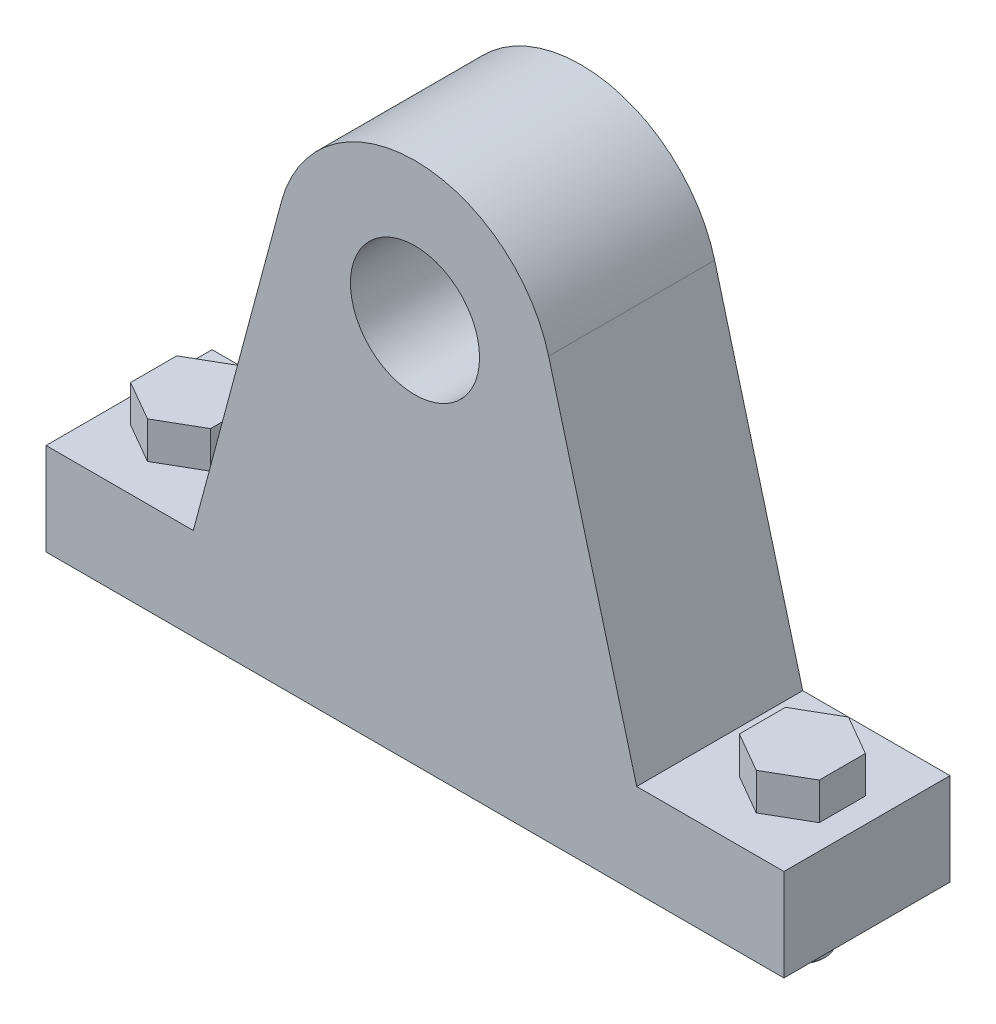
ISO-10303-21;
HEADER;
FILE_DESCRIPTION(('STEP AP214'),'2;1');
FILE_NAME('part.step','',(''),(''),'','','');
FILE_SCHEMA(('AUTOMOTIVE_DESIGN { 1 0 10303 214 1 1 1 1 }'));
ENDSEC;
DATA;
#1=APPLICATION_CONTEXT('core data for automotive mechanical design processes');
#2=APPLICATION_PROTOCOL_DEFINITION('international standard','automotive_design',2000,#1);
#3=PRODUCT_CONTEXT('',#1,'mechanical');
#4=PRODUCT('Part','Part','',(#3));
#5=PRODUCT_RELATED_PRODUCT_CATEGORY('part','',(#4));
#6=PRODUCT_DEFINITION_FORMATION('','',#4);
#7=PRODUCT_DEFINITION_CONTEXT('part definition',#1,'design');
#8=PRODUCT_DEFINITION('design','',#6,#7);
#9=PRODUCT_DEFINITION_SHAPE('','',#8);
#10=(LENGTH_UNIT() NAMED_UNIT(*) SI_UNIT(.MILLI.,.METRE.));
#11=(NAMED_UNIT(*) PLANE_ANGLE_UNIT() SI_UNIT($,.RADIAN.));
#12=(NAMED_UNIT(*) SI_UNIT($,.STERADIAN.) SOLID_ANGLE_UNIT());
#13=UNCERTAINTY_MEASURE_WITH_UNIT(LENGTH_MEASURE(1.E-05),#10,'distance_accuracy_value','');
#14=(GEOMETRIC_REPRESENTATION_CONTEXT(3) GLOBAL_UNCERTAINTY_ASSIGNED_CONTEXT((#13)) GLOBAL_UNIT_ASSIGNED_CONTEXT((#10,
#11,#12)) REPRESENTATION_CONTEXT('',''));
#15=CARTESIAN_POINT('',(0.,0.,0.));
#16=DIRECTION('',(0.,0.,1.));
#17=DIRECTION('',(1.,0.,0.));
#18=AXIS2_PLACEMENT_3D('',#15,#16,#17);
#19=CARTESIAN_POINT('',(0.,-23.3082539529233,9.));
#20=DIRECTION('',(0.,0.,1.));
#21=DIRECTION('',(1.,0.,0.));
#22=AXIS2_PLACEMENT_3D('',#19,#20,#21);
#23=PLANE('',#22);
#24=CARTESIAN_POINT('',(0.,0.,9.));
#25=DIRECTION('',(0.,0.,-1.));
#26=DIRECTION('',(-1.,0.,0.));
#27=AXIS2_PLACEMENT_3D('',#24,#25,#26);
#28=CIRCLE('',#27,7.);
#29=CARTESIAN_POINT('',(7.,0.,9.));
#30=VERTEX_POINT('',#29);
#31=EDGE_CURVE('E408',#30,#30,#28,.T.);
#32=ORIENTED_EDGE('',*,*,#31,.T.);
#33=EDGE_LOOP('',(#32));
#34=FACE_BOUND('',#33,.T.);
#35=DIRECTION('',(-1.,0.,0.));
#36=VECTOR('',#35,1.);
#37=CARTESIAN_POINT('',(40.,-41.75,9.));
#38=LINE('',#37,#36);
#39=CARTESIAN_POINT('',(40.,-41.75,9.));
#40=VERTEX_POINT('',#39);
#41=CARTESIAN_POINT('',(-40.,-41.75,9.));
#42=VERTEX_POINT('',#41);
#43=EDGE_CURVE('E394',#40,#42,#38,.T.);
#44=ORIENTED_EDGE('',*,*,#43,.F.);
#45=DIRECTION('',(0.,-1.,0.));
#46=VECTOR('',#45,1.);
#47=CARTESIAN_POINT('',(40.,-31.75,9.));
#48=LINE('',#47,#46);
#49=CARTESIAN_POINT('',(40.,-31.75,9.));
#50=VERTEX_POINT('',#49);
#51=EDGE_CURVE('E10',#50,#40,#48,.T.);
#52=ORIENTED_EDGE('',*,*,#51,.F.);
#53=DIRECTION('',(1.,0.,0.));
#54=VECTOR('',#53,1.);
#55=CARTESIAN_POINT('',(24.0365295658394,-31.75,9.));
#56=LINE('',#55,#54);
#57=CARTESIAN_POINT('',(24.0365295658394,-31.75,9.));
#58=VERTEX_POINT('',#57);
#59=EDGE_CURVE('E41',#58,#50,#56,.T.);
#60=ORIENTED_EDGE('',*,*,#59,.F.);
#61=DIRECTION('',(0.258819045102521,-0.965925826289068,0.));
#62=VECTOR('',#61,1.);
#63=CARTESIAN_POINT('',(14.488887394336,3.88228567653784,9.));
#64=LINE('',#63,#62);
#65=CARTESIAN_POINT('',(14.488887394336,3.88228567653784,9.));
#66=VERTEX_POINT('',#65);
#67=EDGE_CURVE('E465',#66,#58,#64,.T.);
#68=ORIENTED_EDGE('',*,*,#67,.F.);
#69=CARTESIAN_POINT('',(0.,0.,9.));
#70=DIRECTION('',(0.,0.,-1.));
#71=DIRECTION('',(0.965925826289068,0.258819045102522,0.));
#72=AXIS2_PLACEMENT_3D('',#69,#70,#71);
#73=CIRCLE('',#72,15.);
#74=CARTESIAN_POINT('',(-14.488887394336,3.88228567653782,9.));
#75=VERTEX_POINT('',#74);
#76=EDGE_CURVE('E275',#75,#66,#73,.T.);
#77=ORIENTED_EDGE('',*,*,#76,.F.);
#78=DIRECTION('',(0.258819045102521,0.965925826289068,0.));
#79=VECTOR('',#78,1.);
#80=CARTESIAN_POINT('',(-24.0365295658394,-31.75,9.));
#81=LINE('',#80,#79);
#82=CARTESIAN_POINT('',(-24.0365295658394,-31.75,9.));
#83=VERTEX_POINT('',#82);
#84=EDGE_CURVE('E276',#83,#75,#81,.T.);
#85=ORIENTED_EDGE('',*,*,#84,.F.);
#86=DIRECTION('',(1.,0.,0.));
#87=VECTOR('',#86,1.);
#88=CARTESIAN_POINT('',(-40.,-31.75,9.));
#89=LINE('',#88,#87);
#90=CARTESIAN_POINT('',(-40.,-31.75,9.));
#91=VERTEX_POINT('',#90);
#92=EDGE_CURVE('E358',#91,#83,#89,.T.);
#93=ORIENTED_EDGE('',*,*,#92,.F.);
#94=DIRECTION('',(0.,1.,0.));
#95=VECTOR('',#94,1.);
#96=CARTESIAN_POINT('',(-40.,-41.75,9.));
#97=LINE('',#96,#95);
#98=EDGE_CURVE('E443',#42,#91,#97,.T.);
#99=ORIENTED_EDGE('',*,*,#98,.F.);
#100=EDGE_LOOP('',(#44,#52,#60,#68,#77,#85,#93,#99));
#101=FACE_BOUND('',#100,.T.);
#102=ADVANCED_FACE('F16',(#34,#101),#23,.T.);
#103=CARTESIAN_POINT('',(40.,-31.75,0.));
#104=DIRECTION('',(1.,0.,0.));
#105=DIRECTION('',(0.,1.,0.));
#106=AXIS2_PLACEMENT_3D('',#103,#104,#105);
#107=PLANE('',#106);
#108=ORIENTED_EDGE('',*,*,#51,.T.);
#109=DIRECTION('',(0.,0.,1.));
#110=VECTOR('',#109,1.);
#111=CARTESIAN_POINT('',(40.,-41.75,-9.));
#112=LINE('',#111,#110);
#113=CARTESIAN_POINT('',(40.,-41.75,-9.));
#114=VERTEX_POINT('',#113);
#115=EDGE_CURVE('E427',#114,#40,#112,.T.);
#116=ORIENTED_EDGE('',*,*,#115,.F.);
#117=DIRECTION('',(0.,1.,0.));
#118=VECTOR('',#117,1.);
#119=CARTESIAN_POINT('',(40.,-41.75,-9.));
#120=LINE('',#119,#118);
#121=CARTESIAN_POINT('',(40.,-31.75,-9.));
#122=VERTEX_POINT('',#121);
#123=EDGE_CURVE('E411',#114,#122,#120,.T.);
#124=ORIENTED_EDGE('',*,*,#123,.T.);
#125=DIRECTION('',(0.,0.,1.));
#126=VECTOR('',#125,1.);
#127=CARTESIAN_POINT('',(40.,-31.75,-9.));
#128=LINE('',#127,#126);
#129=EDGE_CURVE('E24',#122,#50,#128,.T.);
#130=ORIENTED_EDGE('',*,*,#129,.T.);
#131=EDGE_LOOP('',(#108,#116,#124,#130));
#132=FACE_BOUND('',#131,.T.);
#133=ADVANCED_FACE('F497',(#132),#107,.T.);
#134=CARTESIAN_POINT('',(24.0365295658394,-31.75,0.));
#135=DIRECTION('',(0.,1.,0.));
#136=DIRECTION('',(1.,0.,0.));
#137=AXIS2_PLACEMENT_3D('',#134,#135,#136);
#138=PLANE('',#137);
#139=DIRECTION('',(0.866025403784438,0.,-0.5));
#140=VECTOR('',#139,1.);
#141=CARTESIAN_POINT('',(28.6698729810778,-31.75,-2.5));
#142=LINE('',#141,#140);
#143=CARTESIAN_POINT('',(28.6698729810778,-31.75,-2.5));
#144=VERTEX_POINT('',#143);
#145=CARTESIAN_POINT('',(33.,-31.75,-5.));
#146=VERTEX_POINT('',#145);
#147=EDGE_CURVE('E261',#144,#146,#142,.T.);
#148=ORIENTED_EDGE('',*,*,#147,.T.);
#149=DIRECTION('',(0.866025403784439,0.,0.5));
#150=VECTOR('',#149,1.);
#151=CARTESIAN_POINT('',(33.,-31.75,-5.));
#152=LINE('',#151,#150);
#153=CARTESIAN_POINT('',(37.3301270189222,-31.75,-2.5));
#154=VERTEX_POINT('',#153);
#155=EDGE_CURVE('E246',#146,#154,#152,.T.);
#156=ORIENTED_EDGE('',*,*,#155,.T.);
#157=DIRECTION('',(0.,0.,1.));
#158=VECTOR('',#157,1.);
#159=CARTESIAN_POINT('',(37.3301270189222,-31.75,-2.5));
#160=LINE('',#159,#158);
#161=CARTESIAN_POINT('',(37.3301270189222,-31.75,2.5));
#162=VERTEX_POINT('',#161);
#163=EDGE_CURVE('E299',#154,#162,#160,.T.);
#164=ORIENTED_EDGE('',*,*,#163,.T.);
#165=DIRECTION('',(-0.866025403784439,0.,0.5));
#166=VECTOR('',#165,1.);
#167=CARTESIAN_POINT('',(37.3301270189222,-31.75,2.5));
#168=LINE('',#167,#166);
#169=CARTESIAN_POINT('',(33.,-31.75,5.));
#170=VERTEX_POINT('',#169);
#171=EDGE_CURVE('E311',#162,#170,#168,.T.);
#172=ORIENTED_EDGE('',*,*,#171,.T.);
#173=DIRECTION('',(-0.866025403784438,0.,-0.5));
#174=VECTOR('',#173,1.);
#175=CARTESIAN_POINT('',(33.,-31.75,5.));
#176=LINE('',#175,#174);
#177=CARTESIAN_POINT('',(28.6698729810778,-31.75,2.5));
#178=VERTEX_POINT('',#177);
#179=EDGE_CURVE('E323',#170,#178,#176,.T.);
#180=ORIENTED_EDGE('',*,*,#179,.T.);
#181=DIRECTION('',(0.,0.,-1.));
#182=VECTOR('',#181,1.);
#183=CARTESIAN_POINT('',(28.6698729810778,-31.75,2.5));
#184=LINE('',#183,#182);
#185=EDGE_CURVE('E330',#178,#144,#184,.T.);
#186=ORIENTED_EDGE('',*,*,#185,.T.);
#187=EDGE_LOOP('',(#148,#156,#164,#172,#180,#186));
#188=FACE_BOUND('',#187,.T.);
#189=ORIENTED_EDGE('',*,*,#59,.T.);
#190=ORIENTED_EDGE('',*,*,#129,.F.);
#191=DIRECTION('',(-1.,0.,0.));
#192=VECTOR('',#191,1.);
#193=CARTESIAN_POINT('',(40.,-31.75,-9.));
#194=LINE('',#193,#192);
#195=CARTESIAN_POINT('',(24.0365295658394,-31.75,-9.));
#196=VERTEX_POINT('',#195);
#197=EDGE_CURVE('E390',#122,#196,#194,.T.);
#198=ORIENTED_EDGE('',*,*,#197,.T.);
#199=DIRECTION('',(0.,0.,1.));
#200=VECTOR('',#199,1.);
#201=CARTESIAN_POINT('',(24.0365295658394,-31.75,-9.));
#202=LINE('',#201,#200);
#203=EDGE_CURVE('E469',#196,#58,#202,.T.);
#204=ORIENTED_EDGE('',*,*,#203,.T.);
#205=EDGE_LOOP('',(#189,#190,#198,#204));
#206=FACE_BOUND('',#205,.T.);
#207=ADVANCED_FACE('F475',(#188,#206),#138,.T.);
#208=CARTESIAN_POINT('',(14.488887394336,3.88228567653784,0.));
#209=DIRECTION('',(0.965925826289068,0.258819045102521,0.));
#210=DIRECTION('',(0.,0.,-1.));
#211=AXIS2_PLACEMENT_3D('',#208,#209,#210);
#212=PLANE('',#211);
#213=ORIENTED_EDGE('',*,*,#67,.T.);
#214=ORIENTED_EDGE('',*,*,#203,.F.);
#215=DIRECTION('',(-0.258819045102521,0.965925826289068,0.));
#216=VECTOR('',#215,1.);
#217=CARTESIAN_POINT('',(24.0365295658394,-31.75,-9.));
#218=LINE('',#217,#216);
#219=CARTESIAN_POINT('',(14.488887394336,3.88228567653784,-9.));
#220=VERTEX_POINT('',#219);
#221=EDGE_CURVE('E395',#196,#220,#218,.T.);
#222=ORIENTED_EDGE('',*,*,#221,.T.);
#223=DIRECTION('',(0.,0.,1.));
#224=VECTOR('',#223,1.);
#225=CARTESIAN_POINT('',(14.488887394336,3.88228567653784,-9.));
#226=LINE('',#225,#224);
#227=EDGE_CURVE('E461',#220,#66,#226,.T.);
#228=ORIENTED_EDGE('',*,*,#227,.T.);
#229=EDGE_LOOP('',(#213,#214,#222,#228));
#230=FACE_BOUND('',#229,.T.);
#231=ADVANCED_FACE('F479',(#230),#212,.T.);
#232=CARTESIAN_POINT('',(0.,0.,0.));
#233=DIRECTION('',(0.,0.,1.));
#234=DIRECTION('',(0.965925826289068,0.258819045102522,0.));
#235=AXIS2_PLACEMENT_3D('',#232,#233,#234);
#236=CYLINDRICAL_SURFACE('',#235,15.);
#237=ORIENTED_EDGE('',*,*,#76,.T.);
#238=ORIENTED_EDGE('',*,*,#227,.F.);
#239=CARTESIAN_POINT('',(0.,0.,-9.));
#240=DIRECTION('',(0.,0.,1.));
#241=DIRECTION('',(0.965925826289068,0.258819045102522,0.));
#242=AXIS2_PLACEMENT_3D('',#239,#240,#241);
#243=CIRCLE('',#242,15.);
#244=CARTESIAN_POINT('',(-14.488887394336,3.88228567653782,-9.));
#245=VERTEX_POINT('',#244);
#246=EDGE_CURVE('E384',#220,#245,#243,.T.);
#247=ORIENTED_EDGE('',*,*,#246,.T.);
#248=DIRECTION('',(0.,0.,1.));
#249=VECTOR('',#248,1.);
#250=CARTESIAN_POINT('',(-14.488887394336,3.88228567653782,-9.));
#251=LINE('',#250,#249);
#252=EDGE_CURVE('E271',#245,#75,#251,.T.);
#253=ORIENTED_EDGE('',*,*,#252,.T.);
#254=EDGE_LOOP('',(#237,#238,#247,#253));
#255=FACE_BOUND('',#254,.T.);
#256=ADVANCED_FACE('F481',(#255),#236,.T.);
#257=CARTESIAN_POINT('',(-24.0365295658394,-31.75,0.));
#258=DIRECTION('',(-0.965925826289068,0.258819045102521,0.));
#259=DIRECTION('',(0.,0.,1.));
#260=AXIS2_PLACEMENT_3D('',#257,#258,#259);
#261=PLANE('',#260);
#262=ORIENTED_EDGE('',*,*,#84,.T.);
#263=ORIENTED_EDGE('',*,*,#252,.F.);
#264=DIRECTION('',(-0.258819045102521,-0.965925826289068,0.));
#265=VECTOR('',#264,1.);
#266=CARTESIAN_POINT('',(-14.488887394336,3.88228567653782,-9.));
#267=LINE('',#266,#265);
#268=CARTESIAN_POINT('',(-24.0365295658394,-31.75,-9.));
#269=VERTEX_POINT('',#268);
#270=EDGE_CURVE('E380',#245,#269,#267,.T.);
#271=ORIENTED_EDGE('',*,*,#270,.T.);
#272=DIRECTION('',(0.,0.,1.));
#273=VECTOR('',#272,1.);
#274=CARTESIAN_POINT('',(-24.0365295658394,-31.75,-9.));
#275=LINE('',#274,#273);
#276=EDGE_CURVE('E362',#269,#83,#275,.T.);
#277=ORIENTED_EDGE('',*,*,#276,.T.);
#278=EDGE_LOOP('',(#262,#263,#271,#277));
#279=FACE_BOUND('',#278,.T.);
#280=ADVANCED_FACE('F485',(#279),#261,.T.);
#281=CARTESIAN_POINT('',(-40.,-31.75,0.));
#282=DIRECTION('',(0.,1.,0.));
#283=DIRECTION('',(1.,0.,0.));
#284=AXIS2_PLACEMENT_3D('',#281,#282,#283);
#285=PLANE('',#284);
#286=DIRECTION('',(0.866025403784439,0.,0.5));
#287=VECTOR('',#286,1.);
#288=CARTESIAN_POINT('',(-33.,-31.75,-5.));
#289=LINE('',#288,#287);
#290=CARTESIAN_POINT('',(-33.,-31.75,-5.));
#291=VERTEX_POINT('',#290);
#292=CARTESIAN_POINT('',(-28.6698729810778,-31.75,-2.5));
#293=VERTEX_POINT('',#292);
#294=EDGE_CURVE('E337',#291,#293,#289,.T.);
#295=ORIENTED_EDGE('',*,*,#294,.T.);
#296=DIRECTION('',(0.,0.,1.));
#297=VECTOR('',#296,1.);
#298=CARTESIAN_POINT('',(-28.6698729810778,-31.75,-2.5));
#299=LINE('',#298,#297);
#300=CARTESIAN_POINT('',(-28.6698729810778,-31.75,2.5));
#301=VERTEX_POINT('',#300);
#302=EDGE_CURVE('E294',#293,#301,#299,.T.);
#303=ORIENTED_EDGE('',*,*,#302,.T.);
#304=DIRECTION('',(-0.866025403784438,0.,0.5));
#305=VECTOR('',#304,1.);
#306=CARTESIAN_POINT('',(-28.6698729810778,-31.75,2.5));
#307=LINE('',#306,#305);
#308=CARTESIAN_POINT('',(-33.,-31.75,5.));
#309=VERTEX_POINT('',#308);
#310=EDGE_CURVE('E353',#301,#309,#307,.T.);
#311=ORIENTED_EDGE('',*,*,#310,.T.);
#312=DIRECTION('',(-0.866025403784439,0.,-0.5));
#313=VECTOR('',#312,1.);
#314=CARTESIAN_POINT('',(-33.,-31.75,5.));
#315=LINE('',#314,#313);
#316=CARTESIAN_POINT('',(-37.3301270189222,-31.75,2.5));
#317=VERTEX_POINT('',#316);
#318=EDGE_CURVE('E371',#309,#317,#315,.T.);
#319=ORIENTED_EDGE('',*,*,#318,.T.);
#320=DIRECTION('',(0.,0.,-1.));
#321=VECTOR('',#320,1.);
#322=CARTESIAN_POINT('',(-37.3301270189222,-31.75,2.5));
#323=LINE('',#322,#321);
#324=CARTESIAN_POINT('',(-37.3301270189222,-31.75,-2.5));
#325=VERTEX_POINT('',#324);
#326=EDGE_CURVE('E389',#317,#325,#323,.T.);
#327=ORIENTED_EDGE('',*,*,#326,.T.);
#328=DIRECTION('',(0.866025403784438,0.,-0.5));
#329=VECTOR('',#328,1.);
#330=CARTESIAN_POINT('',(-37.3301270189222,-31.75,-2.5));
#331=LINE('',#330,#329);
#332=EDGE_CURVE('E402',#325,#291,#331,.T.);
#333=ORIENTED_EDGE('',*,*,#332,.T.);
#334=EDGE_LOOP('',(#295,#303,#311,#319,#327,#333));
#335=FACE_BOUND('',#334,.T.);
#336=ORIENTED_EDGE('',*,*,#92,.T.);
#337=ORIENTED_EDGE('',*,*,#276,.F.);
#338=DIRECTION('',(-1.,0.,0.));
#339=VECTOR('',#338,1.);
#340=CARTESIAN_POINT('',(-24.0365295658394,-31.75,-9.));
#341=LINE('',#340,#339);
#342=CARTESIAN_POINT('',(-40.,-31.75,-9.));
#343=VERTEX_POINT('',#342);
#344=EDGE_CURVE('E385',#269,#343,#341,.T.);
#345=ORIENTED_EDGE('',*,*,#344,.T.);
#346=DIRECTION('',(0.,0.,1.));
#347=VECTOR('',#346,1.);
#348=CARTESIAN_POINT('',(-40.,-31.75,-9.));
#349=LINE('',#348,#347);
#350=EDGE_CURVE('E363',#343,#91,#349,.T.);
#351=ORIENTED_EDGE('',*,*,#350,.T.);
#352=EDGE_LOOP('',(#336,#337,#345,#351));
#353=FACE_BOUND('',#352,.T.);
#354=ADVANCED_FACE('F488',(#335,#353),#285,.T.);
#355=CARTESIAN_POINT('',(-40.,-41.75,0.));
#356=DIRECTION('',(-1.,0.,0.));
#357=DIRECTION('',(0.,0.,1.));
#358=AXIS2_PLACEMENT_3D('',#355,#356,#357);
#359=PLANE('',#358);
#360=ORIENTED_EDGE('',*,*,#98,.T.);
#361=ORIENTED_EDGE('',*,*,#350,.F.);
#362=DIRECTION('',(0.,-1.,0.));
#363=VECTOR('',#362,1.);
#364=CARTESIAN_POINT('',(-40.,-31.75,-9.));
#365=LINE('',#364,#363);
#366=CARTESIAN_POINT('',(-40.,-41.75,-9.));
#367=VERTEX_POINT('',#366);
#368=EDGE_CURVE('E419',#343,#367,#365,.T.);
#369=ORIENTED_EDGE('',*,*,#368,.T.);
#370=DIRECTION('',(0.,0.,1.));
#371=VECTOR('',#370,1.);
#372=CARTESIAN_POINT('',(-40.,-41.75,-9.));
#373=LINE('',#372,#371);
#374=EDGE_CURVE('E423',#367,#42,#373,.T.);
#375=ORIENTED_EDGE('',*,*,#374,.T.);
#376=EDGE_LOOP('',(#360,#361,#369,#375));
#377=FACE_BOUND('',#376,.T.);
#378=ADVANCED_FACE('F490',(#377),#359,.T.);
#379=CARTESIAN_POINT('',(0.,-41.75,0.));
#380=DIRECTION('',(0.,-1.,0.));
#381=DIRECTION('',(0.,0.,-1.));
#382=AXIS2_PLACEMENT_3D('',#379,#380,#381);
#383=PLANE('',#382);
#384=CARTESIAN_POINT('',(-33.,-41.75,0.));
#385=DIRECTION('',(0.,1.,0.));
#386=DIRECTION('',(-1.,0.,0.));
#387=AXIS2_PLACEMENT_3D('',#384,#385,#386);
#388=CIRCLE('',#387,2.5);
#389=CARTESIAN_POINT('',(-30.5,-41.75,0.));
#390=VERTEX_POINT('',#389);
#391=EDGE_CURVE('E257',#390,#390,#388,.T.);
#392=ORIENTED_EDGE('',*,*,#391,.T.);
#393=EDGE_LOOP('',(#392));
#394=FACE_BOUND('',#393,.T.);
#395=CARTESIAN_POINT('',(33.,-41.75,0.));
#396=DIRECTION('',(0.,1.,0.));
#397=DIRECTION('',(-1.,0.,0.));
#398=AXIS2_PLACEMENT_3D('',#395,#396,#397);
#399=CIRCLE('',#398,2.5);
#400=CARTESIAN_POINT('',(35.5,-41.75,0.));
#401=VERTEX_POINT('',#400);
#402=EDGE_CURVE('E237',#401,#401,#399,.T.);
#403=ORIENTED_EDGE('',*,*,#402,.T.);
#404=EDGE_LOOP('',(#403));
#405=FACE_BOUND('',#404,.T.);
#406=ORIENTED_EDGE('',*,*,#43,.T.);
#407=ORIENTED_EDGE('',*,*,#374,.F.);
#408=DIRECTION('',(1.,0.,0.));
#409=VECTOR('',#408,1.);
#410=CARTESIAN_POINT('',(-40.,-41.75,-9.));
#411=LINE('',#410,#409);
#412=EDGE_CURVE('E415',#367,#114,#411,.T.);
#413=ORIENTED_EDGE('',*,*,#412,.T.);
#414=ORIENTED_EDGE('',*,*,#115,.T.);
#415=EDGE_LOOP('',(#406,#407,#413,#414));
#416=FACE_BOUND('',#415,.T.);
#417=ADVANCED_FACE('F494',(#394,#405,#416),#383,.T.);
#418=CARTESIAN_POINT('',(0.,-23.3082539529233,-9.));
#419=DIRECTION('',(0.,0.,1.));
#420=DIRECTION('',(1.,0.,0.));
#421=AXIS2_PLACEMENT_3D('',#418,#419,#420);
#422=PLANE('',#421);
#423=CARTESIAN_POINT('',(0.,0.,-9.));
#424=DIRECTION('',(0.,0.,1.));
#425=DIRECTION('',(-1.,0.,0.));
#426=AXIS2_PLACEMENT_3D('',#423,#424,#425);
#427=CIRCLE('',#426,7.);
#428=CARTESIAN_POINT('',(7.,0.,-9.));
#429=VERTEX_POINT('',#428);
#430=EDGE_CURVE('E405',#429,#429,#427,.T.);
#431=ORIENTED_EDGE('',*,*,#430,.T.);
#432=EDGE_LOOP('',(#431));
#433=FACE_BOUND('',#432,.T.);
#434=ORIENTED_EDGE('',*,*,#123,.F.);
#435=ORIENTED_EDGE('',*,*,#412,.F.);
#436=ORIENTED_EDGE('',*,*,#368,.F.);
#437=ORIENTED_EDGE('',*,*,#344,.F.);
#438=ORIENTED_EDGE('',*,*,#270,.F.);
#439=ORIENTED_EDGE('',*,*,#246,.F.);
#440=ORIENTED_EDGE('',*,*,#221,.F.);
#441=ORIENTED_EDGE('',*,*,#197,.F.);
#442=EDGE_LOOP('',(#434,#435,#436,#437,#438,#439,#440,#441));
#443=FACE_BOUND('',#442,.T.);
#444=ADVANCED_FACE('F499',(#433,#443),#422,.F.);
#445=CARTESIAN_POINT('',(0.,0.,0.));
#446=DIRECTION('',(0.,0.,1.));
#447=DIRECTION('',(-1.,0.,0.));
#448=AXIS2_PLACEMENT_3D('',#445,#446,#447);
#449=CYLINDRICAL_SURFACE('',#448,7.);
#450=ORIENTED_EDGE('',*,*,#31,.F.);
#451=EDGE_LOOP('',(#450));
#452=FACE_BOUND('',#451,.T.);
#453=ORIENTED_EDGE('',*,*,#430,.F.);
#454=EDGE_LOOP('',(#453));
#455=FACE_BOUND('',#454,.T.);
#456=ADVANCED_FACE('F501',(#452,#455),#449,.F.);
#457=CARTESIAN_POINT('',(-33.,-27.75,0.));
#458=DIRECTION('',(0.,1.,0.));
#459=DIRECTION('',(1.,0.,0.));
#460=AXIS2_PLACEMENT_3D('',#457,#458,#459);
#461=PLANE('',#460);
#462=DIRECTION('',(0.866025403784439,0.,0.5));
#463=VECTOR('',#462,1.);
#464=CARTESIAN_POINT('',(-33.,-27.75,-5.));
#465=LINE('',#464,#463);
#466=CARTESIAN_POINT('',(-33.,-27.75,-5.));
#467=VERTEX_POINT('',#466);
#468=CARTESIAN_POINT('',(-28.6698729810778,-27.75,-2.5));
#469=VERTEX_POINT('',#468);
#470=EDGE_CURVE('E240',#467,#469,#465,.T.);
#471=ORIENTED_EDGE('',*,*,#470,.F.);
#472=DIRECTION('',(0.866025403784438,0.,-0.5));
#473=VECTOR('',#472,1.);
#474=CARTESIAN_POINT('',(-37.3301270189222,-27.75,-2.5));
#475=LINE('',#474,#473);
#476=CARTESIAN_POINT('',(-37.3301270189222,-27.75,-2.5));
#477=VERTEX_POINT('',#476);
#478=EDGE_CURVE('E399',#477,#467,#475,.T.);
#479=ORIENTED_EDGE('',*,*,#478,.F.);
#480=DIRECTION('',(0.,0.,-1.));
#481=VECTOR('',#480,1.);
#482=CARTESIAN_POINT('',(-37.3301270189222,-27.75,2.5));
#483=LINE('',#482,#481);
#484=CARTESIAN_POINT('',(-37.3301270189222,-27.75,2.5));
#485=VERTEX_POINT('',#484);
#486=EDGE_CURVE('E375',#485,#477,#483,.T.);
#487=ORIENTED_EDGE('',*,*,#486,.F.);
#488=DIRECTION('',(-0.866025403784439,0.,-0.5));
#489=VECTOR('',#488,1.);
#490=CARTESIAN_POINT('',(-33.,-27.75,5.));
#491=LINE('',#490,#489);
#492=CARTESIAN_POINT('',(-33.,-27.75,5.));
#493=VERTEX_POINT('',#492);
#494=EDGE_CURVE('E357',#493,#485,#491,.T.);
#495=ORIENTED_EDGE('',*,*,#494,.F.);
#496=DIRECTION('',(-0.866025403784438,0.,0.5));
#497=VECTOR('',#496,1.);
#498=CARTESIAN_POINT('',(-28.6698729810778,-27.75,2.5));
#499=LINE('',#498,#497);
#500=CARTESIAN_POINT('',(-28.6698729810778,-27.75,2.5));
#501=VERTEX_POINT('',#500);
#502=EDGE_CURVE('E345',#501,#493,#499,.T.);
#503=ORIENTED_EDGE('',*,*,#502,.F.);
#504=DIRECTION('',(0.,0.,1.));
#505=VECTOR('',#504,1.);
#506=CARTESIAN_POINT('',(-28.6698729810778,-27.75,-2.5));
#507=LINE('',#506,#505);
#508=EDGE_CURVE('E295',#469,#501,#507,.T.);
#509=ORIENTED_EDGE('',*,*,#508,.F.);
#510=EDGE_LOOP('',(#471,#479,#487,#495,#503,#509));
#511=FACE_BOUND('',#510,.T.);
#512=ADVANCED_FACE('F509',(#511),#461,.T.);
#513=CARTESIAN_POINT('',(-37.3301270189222,-31.75,-2.5));
#514=DIRECTION('',(-0.5,0.,-0.866025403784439));
#515=DIRECTION('',(-0.866025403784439,0.,0.5));
#516=AXIS2_PLACEMENT_3D('',#513,#514,#515);
#517=PLANE('',#516);
#518=ORIENTED_EDGE('',*,*,#478,.T.);
#519=DIRECTION('',(0.,1.,0.));
#520=VECTOR('',#519,1.);
#521=CARTESIAN_POINT('',(-33.,-31.75,-5.));
#522=LINE('',#521,#520);
#523=EDGE_CURVE('E338',#291,#467,#522,.T.);
#524=ORIENTED_EDGE('',*,*,#523,.F.);
#525=ORIENTED_EDGE('',*,*,#332,.F.);
#526=DIRECTION('',(0.,1.,0.));
#527=VECTOR('',#526,1.);
#528=CARTESIAN_POINT('',(-37.3301270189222,-31.75,-2.5));
#529=LINE('',#528,#527);
#530=EDGE_CURVE('E379',#325,#477,#529,.T.);
#531=ORIENTED_EDGE('',*,*,#530,.T.);
#532=EDGE_LOOP('',(#518,#524,#525,#531));
#533=FACE_BOUND('',#532,.T.);
#534=ADVANCED_FACE('F575',(#533),#517,.T.);
#535=CARTESIAN_POINT('',(-37.3301270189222,-31.75,2.5));
#536=DIRECTION('',(-1.,0.,0.));
#537=DIRECTION('',(0.,0.,1.));
#538=AXIS2_PLACEMENT_3D('',#535,#536,#537);
#539=PLANE('',#538);
#540=ORIENTED_EDGE('',*,*,#486,.T.);
#541=ORIENTED_EDGE('',*,*,#530,.F.);
#542=ORIENTED_EDGE('',*,*,#326,.F.);
#543=DIRECTION('',(0.,1.,0.));
#544=VECTOR('',#543,1.);
#545=CARTESIAN_POINT('',(-37.3301270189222,-31.75,2.5));
#546=LINE('',#545,#544);
#547=EDGE_CURVE('E367',#317,#485,#546,.T.);
#548=ORIENTED_EDGE('',*,*,#547,.T.);
#549=EDGE_LOOP('',(#540,#541,#542,#548));
#550=FACE_BOUND('',#549,.T.);
#551=ADVANCED_FACE('F586',(#550),#539,.T.);
#552=CARTESIAN_POINT('',(-33.,-31.75,5.));
#553=DIRECTION('',(-0.5,0.,0.866025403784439));
#554=DIRECTION('',(0.,1.,0.));
#555=AXIS2_PLACEMENT_3D('',#552,#553,#554);
#556=PLANE('',#555);
#557=ORIENTED_EDGE('',*,*,#494,.T.);
#558=ORIENTED_EDGE('',*,*,#547,.F.);
#559=ORIENTED_EDGE('',*,*,#318,.F.);
#560=DIRECTION('',(0.,1.,0.));
#561=VECTOR('',#560,1.);
#562=CARTESIAN_POINT('',(-33.,-31.75,5.));
#563=LINE('',#562,#561);
#564=EDGE_CURVE('E349',#309,#493,#563,.T.);
#565=ORIENTED_EDGE('',*,*,#564,.T.);
#566=EDGE_LOOP('',(#557,#558,#559,#565));
#567=FACE_BOUND('',#566,.T.);
#568=ADVANCED_FACE('F597',(#567),#556,.T.);
#569=CARTESIAN_POINT('',(-28.6698729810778,-31.75,2.5));
#570=DIRECTION('',(0.5,0.,0.866025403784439));
#571=DIRECTION('',(0.,-1.,0.));
#572=AXIS2_PLACEMENT_3D('',#569,#570,#571);
#573=PLANE('',#572);
#574=ORIENTED_EDGE('',*,*,#502,.T.);
#575=ORIENTED_EDGE('',*,*,#564,.F.);
#576=ORIENTED_EDGE('',*,*,#310,.F.);
#577=DIRECTION('',(0.,1.,0.));
#578=VECTOR('',#577,1.);
#579=CARTESIAN_POINT('',(-28.6698729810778,-31.75,2.5));
#580=LINE('',#579,#578);
#581=EDGE_CURVE('E290',#301,#501,#580,.T.);
#582=ORIENTED_EDGE('',*,*,#581,.T.);
#583=EDGE_LOOP('',(#574,#575,#576,#582));
#584=FACE_BOUND('',#583,.T.);
#585=ADVANCED_FACE('F608',(#584),#573,.T.);
#586=CARTESIAN_POINT('',(-28.6698729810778,-31.75,-2.5));
#587=DIRECTION('',(1.,0.,0.));
#588=DIRECTION('',(0.,1.,0.));
#589=AXIS2_PLACEMENT_3D('',#586,#587,#588);
#590=PLANE('',#589);
#591=ORIENTED_EDGE('',*,*,#508,.T.);
#592=ORIENTED_EDGE('',*,*,#581,.F.);
#593=ORIENTED_EDGE('',*,*,#302,.F.);
#594=DIRECTION('',(0.,1.,0.));
#595=VECTOR('',#594,1.);
#596=CARTESIAN_POINT('',(-28.6698729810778,-31.75,-2.5));
#597=LINE('',#596,#595);
#598=EDGE_CURVE('E333',#293,#469,#597,.T.);
#599=ORIENTED_EDGE('',*,*,#598,.T.);
#600=EDGE_LOOP('',(#591,#592,#593,#599));
#601=FACE_BOUND('',#600,.T.);
#602=ADVANCED_FACE('F620',(#601),#590,.T.);
#603=CARTESIAN_POINT('',(-33.,-31.75,-5.));
#604=DIRECTION('',(0.5,0.,-0.866025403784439));
#605=DIRECTION('',(0.,-1.,0.));
#606=AXIS2_PLACEMENT_3D('',#603,#604,#605);
#607=PLANE('',#606);
#608=ORIENTED_EDGE('',*,*,#470,.T.);
#609=ORIENTED_EDGE('',*,*,#598,.F.);
#610=ORIENTED_EDGE('',*,*,#294,.F.);
#611=ORIENTED_EDGE('',*,*,#523,.T.);
#612=EDGE_LOOP('',(#608,#609,#610,#611));
#613=FACE_BOUND('',#612,.T.);
#614=ADVANCED_FACE('F632',(#613),#607,.T.);
#615=CARTESIAN_POINT('',(33.,-27.75,0.));
#616=DIRECTION('',(0.,1.,0.));
#617=DIRECTION('',(1.,0.,0.));
#618=AXIS2_PLACEMENT_3D('',#615,#616,#617);
#619=PLANE('',#618);
#620=DIRECTION('',(0.866025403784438,0.,-0.5));
#621=VECTOR('',#620,1.);
#622=CARTESIAN_POINT('',(28.6698729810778,-27.75,-2.5));
#623=LINE('',#622,#621);
#624=CARTESIAN_POINT('',(28.6698729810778,-27.75,-2.5));
#625=VERTEX_POINT('',#624);
#626=CARTESIAN_POINT('',(33.,-27.75,-5.));
#627=VERTEX_POINT('',#626);
#628=EDGE_CURVE('E260',#625,#627,#623,.T.);
#629=ORIENTED_EDGE('',*,*,#628,.F.);
#630=DIRECTION('',(0.,0.,-1.));
#631=VECTOR('',#630,1.);
#632=CARTESIAN_POINT('',(28.6698729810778,-27.75,2.5));
#633=LINE('',#632,#631);
#634=CARTESIAN_POINT('',(28.6698729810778,-27.75,2.5));
#635=VERTEX_POINT('',#634);
#636=EDGE_CURVE('E327',#635,#625,#633,.T.);
#637=ORIENTED_EDGE('',*,*,#636,.F.);
#638=DIRECTION('',(-0.866025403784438,0.,-0.5));
#639=VECTOR('',#638,1.);
#640=CARTESIAN_POINT('',(33.,-27.75,5.));
#641=LINE('',#640,#639);
#642=CARTESIAN_POINT('',(33.,-27.75,5.));
#643=VERTEX_POINT('',#642);
#644=EDGE_CURVE('E315',#643,#635,#641,.T.);
#645=ORIENTED_EDGE('',*,*,#644,.F.);
#646=DIRECTION('',(-0.866025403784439,0.,0.5));
#647=VECTOR('',#646,1.);
#648=CARTESIAN_POINT('',(37.3301270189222,-27.75,2.5));
#649=LINE('',#648,#647);
#650=CARTESIAN_POINT('',(37.3301270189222,-27.75,2.5));
#651=VERTEX_POINT('',#650);
#652=EDGE_CURVE('E303',#651,#643,#649,.T.);
#653=ORIENTED_EDGE('',*,*,#652,.F.);
#654=DIRECTION('',(0.,0.,1.));
#655=VECTOR('',#654,1.);
#656=CARTESIAN_POINT('',(37.3301270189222,-27.75,-2.5));
#657=LINE('',#656,#655);
#658=CARTESIAN_POINT('',(37.3301270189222,-27.75,-2.5));
#659=VERTEX_POINT('',#658);
#660=EDGE_CURVE('E250',#659,#651,#657,.T.);
#661=ORIENTED_EDGE('',*,*,#660,.F.);
#662=DIRECTION('',(0.866025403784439,0.,0.5));
#663=VECTOR('',#662,1.);
#664=CARTESIAN_POINT('',(33.,-27.75,-5.));
#665=LINE('',#664,#663);
#666=EDGE_CURVE('E270',#627,#659,#665,.T.);
#667=ORIENTED_EDGE('',*,*,#666,.F.);
#668=EDGE_LOOP('',(#629,#637,#645,#653,#661,#667));
#669=FACE_BOUND('',#668,.T.);
#670=ADVANCED_FACE('F644',(#669),#619,.T.);
#671=CARTESIAN_POINT('',(28.6698729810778,-31.75,2.5));
#672=DIRECTION('',(-1.,0.,0.));
#673=DIRECTION('',(0.,0.,1.));
#674=AXIS2_PLACEMENT_3D('',#671,#672,#673);
#675=PLANE('',#674);
#676=ORIENTED_EDGE('',*,*,#636,.T.);
#677=DIRECTION('',(0.,1.,0.));
#678=VECTOR('',#677,1.);
#679=CARTESIAN_POINT('',(28.6698729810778,-31.75,-2.5));
#680=LINE('',#679,#678);
#681=EDGE_CURVE('E265',#144,#625,#680,.T.);
#682=ORIENTED_EDGE('',*,*,#681,.F.);
#683=ORIENTED_EDGE('',*,*,#185,.F.);
#684=DIRECTION('',(0.,1.,0.));
#685=VECTOR('',#684,1.);
#686=CARTESIAN_POINT('',(28.6698729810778,-31.75,2.5));
#687=LINE('',#686,#685);
#688=EDGE_CURVE('E319',#178,#635,#687,.T.);
#689=ORIENTED_EDGE('',*,*,#688,.T.);
#690=EDGE_LOOP('',(#676,#682,#683,#689));
#691=FACE_BOUND('',#690,.T.);
#692=ADVANCED_FACE('F656',(#691),#675,.T.);
#693=CARTESIAN_POINT('',(33.,-31.75,5.));
#694=DIRECTION('',(-0.5,0.,0.866025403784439));
#695=DIRECTION('',(0.,1.,0.));
#696=AXIS2_PLACEMENT_3D('',#693,#694,#695);
#697=PLANE('',#696);
#698=ORIENTED_EDGE('',*,*,#644,.T.);
#699=ORIENTED_EDGE('',*,*,#688,.F.);
#700=ORIENTED_EDGE('',*,*,#179,.F.);
#701=DIRECTION('',(0.,1.,0.));
#702=VECTOR('',#701,1.);
#703=CARTESIAN_POINT('',(33.,-31.75,5.));
#704=LINE('',#703,#702);
#705=EDGE_CURVE('E307',#170,#643,#704,.T.);
#706=ORIENTED_EDGE('',*,*,#705,.T.);
#707=EDGE_LOOP('',(#698,#699,#700,#706));
#708=FACE_BOUND('',#707,.T.);
#709=ADVANCED_FACE('F667',(#708),#697,.T.);
#710=CARTESIAN_POINT('',(37.3301270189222,-31.75,2.5));
#711=DIRECTION('',(0.5,0.,0.866025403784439));
#712=DIRECTION('',(0.,-1.,0.));
#713=AXIS2_PLACEMENT_3D('',#710,#711,#712);
#714=PLANE('',#713);
#715=ORIENTED_EDGE('',*,*,#652,.T.);
#716=ORIENTED_EDGE('',*,*,#705,.F.);
#717=ORIENTED_EDGE('',*,*,#171,.F.);
#718=DIRECTION('',(0.,1.,0.));
#719=VECTOR('',#718,1.);
#720=CARTESIAN_POINT('',(37.3301270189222,-31.75,2.5));
#721=LINE('',#720,#719);
#722=EDGE_CURVE('E283',#162,#651,#721,.T.);
#723=ORIENTED_EDGE('',*,*,#722,.T.);
#724=EDGE_LOOP('',(#715,#716,#717,#723));
#725=FACE_BOUND('',#724,.T.);
#726=ADVANCED_FACE('F679',(#725),#714,.T.);
#727=CARTESIAN_POINT('',(37.3301270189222,-31.75,-2.5));
#728=DIRECTION('',(1.,0.,0.));
#729=DIRECTION('',(0.,1.,0.));
#730=AXIS2_PLACEMENT_3D('',#727,#728,#729);
#731=PLANE('',#730);
#732=ORIENTED_EDGE('',*,*,#660,.T.);
#733=ORIENTED_EDGE('',*,*,#722,.F.);
#734=ORIENTED_EDGE('',*,*,#163,.F.);
#735=DIRECTION('',(0.,1.,0.));
#736=VECTOR('',#735,1.);
#737=CARTESIAN_POINT('',(37.3301270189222,-31.75,-2.5));
#738=LINE('',#737,#736);
#739=EDGE_CURVE('E251',#154,#659,#738,.T.);
#740=ORIENTED_EDGE('',*,*,#739,.T.);
#741=EDGE_LOOP('',(#732,#733,#734,#740));
#742=FACE_BOUND('',#741,.T.);
#743=ADVANCED_FACE('F691',(#742),#731,.T.);
#744=CARTESIAN_POINT('',(33.,-31.75,-5.));
#745=DIRECTION('',(0.5,0.,-0.866025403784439));
#746=DIRECTION('',(0.,-1.,0.));
#747=AXIS2_PLACEMENT_3D('',#744,#745,#746);
#748=PLANE('',#747);
#749=ORIENTED_EDGE('',*,*,#666,.T.);
#750=ORIENTED_EDGE('',*,*,#739,.F.);
#751=ORIENTED_EDGE('',*,*,#155,.F.);
#752=DIRECTION('',(0.,1.,0.));
#753=VECTOR('',#752,1.);
#754=CARTESIAN_POINT('',(33.,-31.75,-5.));
#755=LINE('',#754,#753);
#756=EDGE_CURVE('E266',#146,#627,#755,.T.);
#757=ORIENTED_EDGE('',*,*,#756,.T.);
#758=EDGE_LOOP('',(#749,#750,#751,#757));
#759=FACE_BOUND('',#758,.T.);
#760=ADVANCED_FACE('F702',(#759),#748,.T.);
#761=CARTESIAN_POINT('',(28.6698729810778,-31.75,-2.5));
#762=DIRECTION('',(-0.5,0.,-0.866025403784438));
#763=DIRECTION('',(-0.866025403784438,0.,0.5));
#764=AXIS2_PLACEMENT_3D('',#761,#762,#763);
#765=PLANE('',#764);
#766=ORIENTED_EDGE('',*,*,#628,.T.);
#767=ORIENTED_EDGE('',*,*,#756,.F.);
#768=ORIENTED_EDGE('',*,*,#147,.F.);
#769=ORIENTED_EDGE('',*,*,#681,.T.);
#770=EDGE_LOOP('',(#766,#767,#768,#769));
#771=FACE_BOUND('',#770,.T.);
#772=ADVANCED_FACE('F712',(#771),#765,.T.);
#773=CARTESIAN_POINT('',(-33.,-46.75,0.));
#774=DIRECTION('',(0.,1.,0.));
#775=DIRECTION('',(1.,0.,0.));
#776=AXIS2_PLACEMENT_3D('',#773,#774,#775);
#777=PLANE('',#776);
#778=CARTESIAN_POINT('',(-33.,-46.75,0.));
#779=DIRECTION('',(0.,1.,0.));
#780=DIRECTION('',(-1.,0.,0.));
#781=AXIS2_PLACEMENT_3D('',#778,#779,#780);
#782=CIRCLE('',#781,2.3);
#783=CARTESIAN_POINT('',(-30.7,-46.75,0.));
#784=VERTEX_POINT('',#783);
#785=EDGE_CURVE('E245',#784,#784,#782,.T.);
#786=ORIENTED_EDGE('',*,*,#785,.F.);
#787=EDGE_LOOP('',(#786));
#788=FACE_BOUND('',#787,.T.);
#789=ADVANCED_FACE('F722',(#788),#777,.F.);
#790=CARTESIAN_POINT('',(-33.,-41.75,0.));
#791=DIRECTION('',(0.,-1.,0.));
#792=DIRECTION('',(-1.,0.,0.));
#793=AXIS2_PLACEMENT_3D('',#790,#791,#792);
#794=CYLINDRICAL_SURFACE('',#793,2.5);
#795=CARTESIAN_POINT('',(-33.,-46.55,0.));
#796=DIRECTION('',(0.,-1.,0.));
#797=DIRECTION('',(-1.,0.,0.));
#798=AXIS2_PLACEMENT_3D('',#795,#796,#797);
#799=CIRCLE('',#798,2.5);
#800=CARTESIAN_POINT('',(-30.5,-46.55,0.));
#801=VERTEX_POINT('',#800);
#802=EDGE_CURVE('E254',#801,#801,#799,.T.);
#803=ORIENTED_EDGE('',*,*,#802,.F.);
#804=EDGE_LOOP('',(#803));
#805=FACE_BOUND('',#804,.T.);
#806=ORIENTED_EDGE('',*,*,#391,.F.);
#807=EDGE_LOOP('',(#806));
#808=FACE_BOUND('',#807,.T.);
#809=ADVANCED_FACE('F732',(#805,#808),#794,.T.);
#810=CARTESIAN_POINT('',(-33.,-46.65,0.));
#811=DIRECTION('',(0.,1.,0.));
#812=DIRECTION('',(-1.,0.,0.));
#813=AXIS2_PLACEMENT_3D('',#810,#811,#812);
#814=CONICAL_SURFACE('',#813,2.4,0.785398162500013);
#815=ORIENTED_EDGE('',*,*,#802,.T.);
#816=EDGE_LOOP('',(#815));
#817=FACE_BOUND('',#816,.T.);
#818=ORIENTED_EDGE('',*,*,#785,.T.);
#819=EDGE_LOOP('',(#818));
#820=FACE_BOUND('',#819,.T.);
#821=ADVANCED_FACE('F743',(#817,#820),#814,.T.);
#822=CARTESIAN_POINT('',(33.,-46.75,0.));
#823=DIRECTION('',(0.,1.,0.));
#824=DIRECTION('',(1.,0.,0.));
#825=AXIS2_PLACEMENT_3D('',#822,#823,#824);
#826=PLANE('',#825);
#827=CARTESIAN_POINT('',(33.,-46.75,0.));
#828=DIRECTION('',(0.,1.,0.));
#829=DIRECTION('',(-1.,0.,0.));
#830=AXIS2_PLACEMENT_3D('',#827,#828,#829);
#831=CIRCLE('',#830,2.3);
#832=CARTESIAN_POINT('',(35.3,-46.75,0.));
#833=VERTEX_POINT('',#832);
#834=EDGE_CURVE('E227',#833,#833,#831,.T.);
#835=ORIENTED_EDGE('',*,*,#834,.F.);
#836=EDGE_LOOP('',(#835));
#837=FACE_BOUND('',#836,.T.);
#838=ADVANCED_FACE('F754',(#837),#826,.F.);
#839=CARTESIAN_POINT('',(33.,-41.75,0.));
#840=DIRECTION('',(0.,-1.,0.));
#841=DIRECTION('',(-1.,0.,0.));
#842=AXIS2_PLACEMENT_3D('',#839,#840,#841);
#843=CYLINDRICAL_SURFACE('',#842,2.5);
#844=CARTESIAN_POINT('',(33.,-46.55,0.));
#845=DIRECTION('',(0.,-1.,0.));
#846=DIRECTION('',(-1.,0.,0.));
#847=AXIS2_PLACEMENT_3D('',#844,#845,#846);
#848=CIRCLE('',#847,2.5);
#849=CARTESIAN_POINT('',(35.5,-46.55,0.));
#850=VERTEX_POINT('',#849);
#851=EDGE_CURVE('E231',#850,#850,#848,.T.);
#852=ORIENTED_EDGE('',*,*,#851,.F.);
#853=EDGE_LOOP('',(#852));
#854=FACE_BOUND('',#853,.T.);
#855=ORIENTED_EDGE('',*,*,#402,.F.);
#856=EDGE_LOOP('',(#855));
#857=FACE_BOUND('',#856,.T.);
#858=ADVANCED_FACE('F765',(#854,#857),#843,.T.);
#859=CARTESIAN_POINT('',(33.,-46.65,0.));
#860=DIRECTION('',(0.,1.,0.));
#861=DIRECTION('',(-1.,0.,0.));
#862=AXIS2_PLACEMENT_3D('',#859,#860,#861);
#863=CONICAL_SURFACE('',#862,2.4,0.785398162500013);
#864=ORIENTED_EDGE('',*,*,#851,.T.);
#865=EDGE_LOOP('',(#864));
#866=FACE_BOUND('',#865,.T.);
#867=ORIENTED_EDGE('',*,*,#834,.T.);
#868=EDGE_LOOP('',(#867));
#869=FACE_BOUND('',#868,.T.);
#870=ADVANCED_FACE('F228',(#866,#869),#863,.T.);
#871=CLOSED_SHELL('',(#102,#133,#207,#231,#256,#280,#354,#378,#417,#444,#456,#512,#534,#551,
#568,#585,#602,#614,#670,#692,#709,#726,#743,#760,#772,#789,#809,#821,#838,#858,#870));
#872=MANIFOLD_SOLID_BREP('B1',#871);
#873=ADVANCED_BREP_SHAPE_REPRESENTATION('',(#18,#872),#14);
#874=SHAPE_DEFINITION_REPRESENTATION(#9,#873);
ENDSEC;
END-ISO-10303-21;
